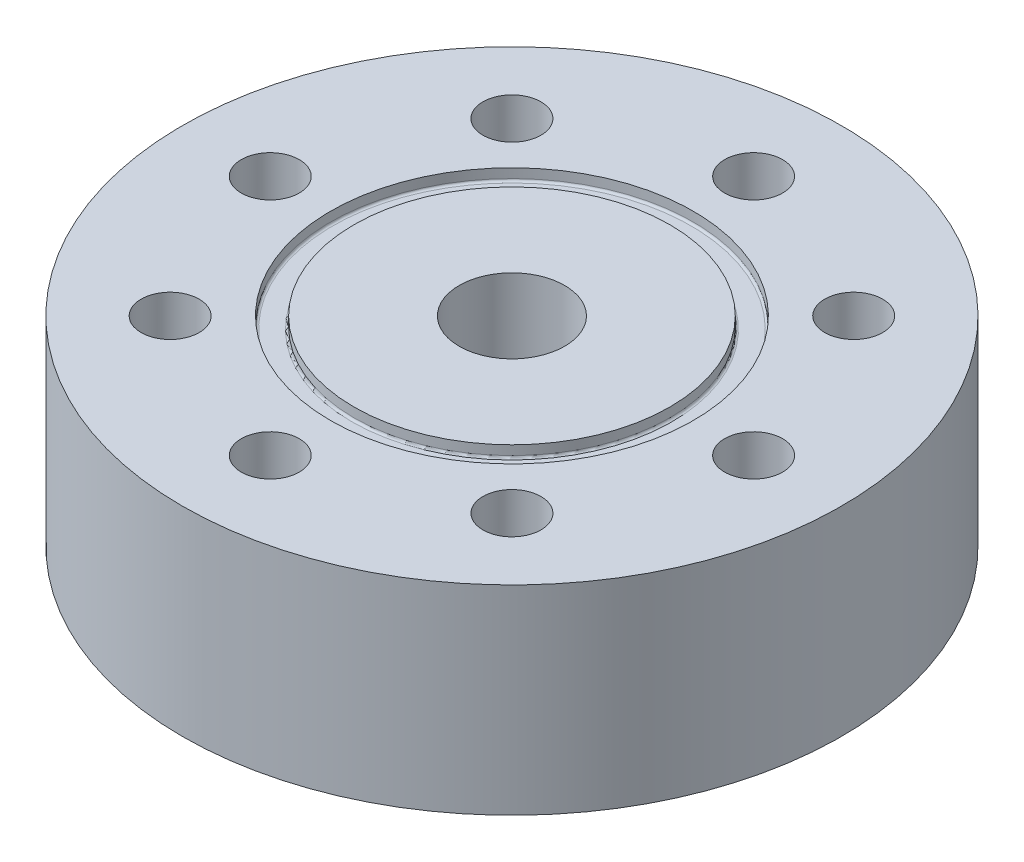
from build123d import *

# Parameters (mm, degrees)
SKETCH2_R                 = 37.5
OUTER_CYLINDER_DEPTH      = 22.7
SKETCH3_R                 = 8.93
NPT_HOLE_DEPTH            = 12.7
SKETCH4_R                 = 3.3
BOLT_HOLES_DEPTH          = 58.687000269
SKETCH5_R                 = 20.6375
SKETCH5_R_2               = 17.9705
O_RING_GROOVE_DEPTH       = 1.3208
FILLET1_R                 = 0.254
SKETCH6_R                 = 6
INLET_FLOW_DIAMETER_DEPTH = 10


with BuildPart() as part:
    # Sketch2 → Outer Cylinder (new body)
    with BuildSketch(Plane(origin=(0, 0, 0), x_dir=(1, 0, 0), z_dir=(0, 1, 0))):
        with Locations(Location((0, 0, 0), (0, 0, 270))):
            Circle(SKETCH2_R)
    extrude(amount=OUTER_CYLINDER_DEPTH)

    # Sketch3 → NPT Hole (cut)
    with BuildSketch(Plane.XZ):
        with Locations(Location((0, 0, 0), (0, 0, 270))):
            Circle(SKETCH3_R)
    extrude(amount=-NPT_HOLE_DEPTH, mode=Mode.SUBTRACT)

    # Sketch4 → Bolt Holes (cut, through all)
    with BuildSketch(Plane.XZ):
        with Locations(Location((-27.5, 0, 0), (0, 0, 270))):
            Circle(SKETCH4_R)
        with Locations(Location((-19.445436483, 19.445436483, 0), (0, 0, 270))):
            Circle(SKETCH4_R)
        with Locations(Location((0, 27.5, 0), (0, 0, 270))):
            Circle(SKETCH4_R)
        with Locations(Location((19.445436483, 19.445436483, 0), (0, 0, 270))):
            Circle(SKETCH4_R)
        with Locations(Location((27.5, 0, 0), (0, 0, 270))):
            Circle(SKETCH4_R)
        with Locations(Location((19.445436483, -19.445436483, 0), (0, 0, 270))):
            Circle(SKETCH4_R)
        with Locations(Location((0, -27.5, 0), (0, 0, 270))):
            Circle(SKETCH4_R)
        with Locations(Location((-19.445436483, -19.445436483, 0), (0, 0, 270))):
            Circle(SKETCH4_R)
    extrude(amount=-BOLT_HOLES_DEPTH, mode=Mode.SUBTRACT)

    # Sketch5 → O-Ring Groove (cut)
    with BuildSketch(Plane(origin=(0, 22.7, 0), x_dir=(1, 0, 0), z_dir=(0, 1, 0))):
        with Locations(Location((0, 0, 0), (0, 0, 270))):
            Circle(SKETCH5_R)
        with Locations(Location((0, 0, 0), (0, 0, 270))):
            Circle(SKETCH5_R_2, mode=Mode.SUBTRACT)
    extrude(amount=-O_RING_GROOVE_DEPTH, mode=Mode.SUBTRACT)

    # Fillet1
    fillet1_edges = [part.edges().sort_by_distance(p)[0] for p in [
        (0, 21.3792, -20.6375),
        (0, 21.3792, -17.9705),
    ]]
    fillet(fillet1_edges, radius=FILLET1_R)

    # Sketch6 → Inlet Flow Diameter (cut)
    with BuildSketch(Plane(origin=(0, 22.7, 0), x_dir=(1, 0, 0), z_dir=(0, 1, 0))):
        with Locations(Location((0, 0, 0), (0, 0, 270))):
            Circle(SKETCH6_R)
    extrude(amount=-INLET_FLOW_DIAMETER_DEPTH, mode=Mode.SUBTRACT)


solid = part.part
